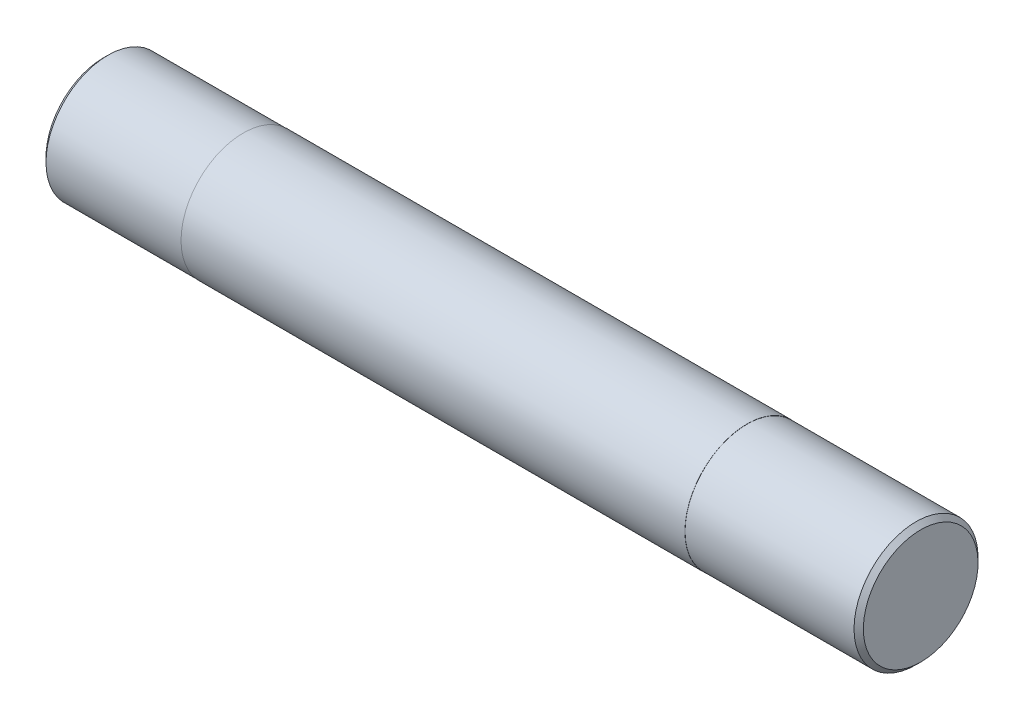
from build123d import *

# Parameters (mm, degrees)
CHANFREIN1_SIZE = 0.3


with BuildPart() as part:
    # Esquisse2 → Base-R_volution (revolve)
    with BuildSketch(Plane.XY, mode=Mode.PRIVATE) as base_r_volution_sk:
        Polygon((-17.3, 4), (0, 4), (15.125799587, 4), (15.125734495, 3.99), (26.3, 3.99), (26.3, 0), (-26.3, 0), (-26.3, 3.99), (-17.3, 3.99), align=None)
    revolve(base_r_volution_sk.sketch.rotate(Axis((-20, 0, 0), (1, 0, 0)), 90), axis=Axis((-20, 0, 0), (1, 0, 0)))

    # Chanfrein1
    chanfrein1_edges = [part.edges().sort_by_distance(p)[0] for p in [
        (26.3, 0, -3.99),
        (-26.3, 0, -3.99),
    ]]
    chamfer(chanfrein1_edges, length=CHANFREIN1_SIZE)


solid = part.part
